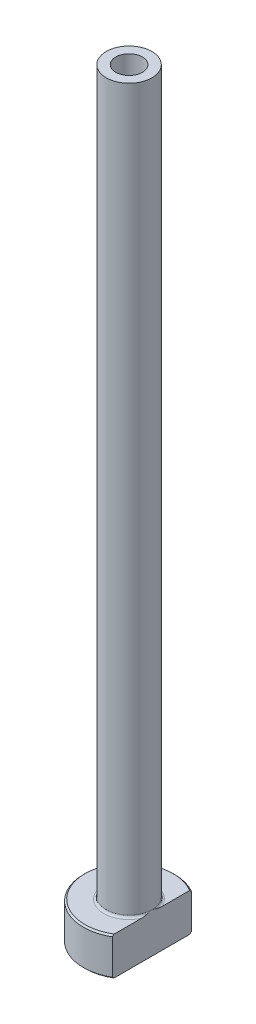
ISO-10303-21;
HEADER;
FILE_DESCRIPTION(('STEP AP214'),'2;1');
FILE_NAME('part.step','',(''),(''),'','','');
FILE_SCHEMA(('AUTOMOTIVE_DESIGN { 1 0 10303 214 1 1 1 1 }'));
ENDSEC;
DATA;
#1=APPLICATION_CONTEXT('core data for automotive mechanical design processes');
#2=APPLICATION_PROTOCOL_DEFINITION('international standard','automotive_design',2000,#1);
#3=PRODUCT_CONTEXT('',#1,'mechanical');
#4=PRODUCT('Part','Part','',(#3));
#5=PRODUCT_RELATED_PRODUCT_CATEGORY('part','',(#4));
#6=PRODUCT_DEFINITION_FORMATION('','',#4);
#7=PRODUCT_DEFINITION_CONTEXT('part definition',#1,'design');
#8=PRODUCT_DEFINITION('design','',#6,#7);
#9=PRODUCT_DEFINITION_SHAPE('','',#8);
#10=(LENGTH_UNIT() NAMED_UNIT(*) SI_UNIT(.MILLI.,.METRE.));
#11=(NAMED_UNIT(*) PLANE_ANGLE_UNIT() SI_UNIT($,.RADIAN.));
#12=(NAMED_UNIT(*) SI_UNIT($,.STERADIAN.) SOLID_ANGLE_UNIT());
#13=UNCERTAINTY_MEASURE_WITH_UNIT(LENGTH_MEASURE(1.E-05),#10,'distance_accuracy_value','');
#14=(GEOMETRIC_REPRESENTATION_CONTEXT(3) GLOBAL_UNCERTAINTY_ASSIGNED_CONTEXT((#13)) GLOBAL_UNIT_ASSIGNED_CONTEXT((#10,
#11,#12)) REPRESENTATION_CONTEXT('',''));
#15=CARTESIAN_POINT('',(0.,0.,0.));
#16=DIRECTION('',(0.,0.,1.));
#17=DIRECTION('',(1.,0.,0.));
#18=AXIS2_PLACEMENT_3D('',#15,#16,#17);
#19=CARTESIAN_POINT('',(0.,92.1876809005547,0.));
#20=DIRECTION('',(0.,1.,0.));
#21=DIRECTION('',(0.,0.,1.));
#22=AXIS2_PLACEMENT_3D('',#19,#20,#21);
#23=CYLINDRICAL_SURFACE('',#22,1.74999999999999);
#24=CARTESIAN_POINT('',(0.,100.,0.));
#25=DIRECTION('',(0.,1.,0.));
#26=DIRECTION('',(0.,0.,1.));
#27=AXIS2_PLACEMENT_3D('',#24,#25,#26);
#28=CIRCLE('',#27,1.74999999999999);
#29=CARTESIAN_POINT('',(0.,100.,1.74999999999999));
#30=VERTEX_POINT('',#29);
#31=EDGE_CURVE('E167',#30,#30,#28,.T.);
#32=ORIENTED_EDGE('',*,*,#31,.T.);
#33=EDGE_LOOP('',(#32));
#34=FACE_BOUND('',#33,.T.);
#35=CARTESIAN_POINT('',(0.,55.,0.));
#36=DIRECTION('',(0.,1.,0.));
#37=DIRECTION('',(0.,0.,1.));
#38=AXIS2_PLACEMENT_3D('',#35,#36,#37);
#39=CIRCLE('',#38,1.74999999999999);
#40=CARTESIAN_POINT('',(0.,55.,1.74999999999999));
#41=VERTEX_POINT('',#40);
#42=EDGE_CURVE('E170',#41,#41,#39,.T.);
#43=ORIENTED_EDGE('',*,*,#42,.F.);
#44=EDGE_LOOP('',(#43));
#45=FACE_BOUND('',#44,.T.);
#46=ADVANCED_FACE('F32',(#34,#45),#23,.F.);
#47=CARTESIAN_POINT('',(-1.74999999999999,100.,0.));
#48=DIRECTION('',(0.,1.,0.));
#49=DIRECTION('',(0.,0.,1.));
#50=AXIS2_PLACEMENT_3D('',#47,#48,#49);
#51=PLANE('',#50);
#52=CARTESIAN_POINT('',(0.,100.,0.));
#53=DIRECTION('',(0.,1.,0.));
#54=DIRECTION('',(0.,0.,1.));
#55=AXIS2_PLACEMENT_3D('',#52,#53,#54);
#56=CIRCLE('',#55,3.);
#57=CARTESIAN_POINT('',(0.,100.,3.));
#58=VERTEX_POINT('',#57);
#59=EDGE_CURVE('E174',#58,#58,#56,.T.);
#60=ORIENTED_EDGE('',*,*,#59,.T.);
#61=EDGE_LOOP('',(#60));
#62=FACE_BOUND('',#61,.T.);
#63=ORIENTED_EDGE('',*,*,#31,.F.);
#64=EDGE_LOOP('',(#63));
#65=FACE_BOUND('',#64,.T.);
#66=ADVANCED_FACE('F157',(#62,#65),#51,.T.);
#67=CARTESIAN_POINT('',(0.,92.1876809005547,0.));
#68=DIRECTION('',(0.,1.,0.));
#69=DIRECTION('',(0.,0.,1.));
#70=AXIS2_PLACEMENT_3D('',#67,#68,#69);
#71=CYLINDRICAL_SURFACE('',#70,2.99999999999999);
#72=CARTESIAN_POINT('',(0.,5.3,0.));
#73=DIRECTION('',(0.,1.,0.));
#74=DIRECTION('',(0.,0.,1.));
#75=AXIS2_PLACEMENT_3D('',#72,#73,#74);
#76=CIRCLE('',#75,2.99999999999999);
#77=CARTESIAN_POINT('',(2.99999999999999,5.3,0.));
#78=VERTEX_POINT('',#77);
#79=EDGE_CURVE('E180',#78,#78,#76,.T.);
#80=ORIENTED_EDGE('',*,*,#79,.T.);
#81=EDGE_LOOP('',(#80));
#82=FACE_BOUND('',#81,.T.);
#83=ORIENTED_EDGE('',*,*,#59,.F.);
#84=EDGE_LOOP('',(#83));
#85=FACE_BOUND('',#84,.T.);
#86=ADVANCED_FACE('F162',(#82,#85),#71,.T.);
#87=CARTESIAN_POINT('',(-2.99999999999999,5.,0.));
#88=DIRECTION('',(0.,1.,0.));
#89=DIRECTION('',(0.,0.,1.));
#90=AXIS2_PLACEMENT_3D('',#87,#88,#89);
#91=PLANE('',#90);
#92=DIRECTION('',(0.,0.,1.));
#93=VECTOR('',#92,1.);
#94=CARTESIAN_POINT('',(2.99999999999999,5.,0.));
#95=LINE('',#94,#93);
#96=CARTESIAN_POINT('',(3.,5.,-4.96386945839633));
#97=VERTEX_POINT('',#96);
#98=CARTESIAN_POINT('',(2.99999999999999,5.,-1.37477270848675));
#99=VERTEX_POINT('',#98);
#100=EDGE_CURVE('E54',#97,#99,#95,.T.);
#101=ORIENTED_EDGE('',*,*,#100,.F.);
#102=CARTESIAN_POINT('',(0.,5.,0.));
#103=DIRECTION('',(0.,1.,0.));
#104=DIRECTION('',(0.,0.,1.));
#105=AXIS2_PLACEMENT_3D('',#102,#103,#104);
#106=CIRCLE('',#105,5.79999999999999);
#107=CARTESIAN_POINT('',(2.99999999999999,5.,4.96386945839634));
#108=VERTEX_POINT('',#107);
#109=EDGE_CURVE('E186',#97,#108,#106,.T.);
#110=ORIENTED_EDGE('',*,*,#109,.T.);
#111=CARTESIAN_POINT('',(2.99999999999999,5.,1.37477270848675));
#112=VERTEX_POINT('',#111);
#113=EDGE_CURVE('E134',#112,#108,#95,.T.);
#114=ORIENTED_EDGE('',*,*,#113,.F.);
#115=CARTESIAN_POINT('',(0.,5.,0.));
#116=DIRECTION('',(0.,1.,0.));
#117=DIRECTION('',(0.,0.,1.));
#118=AXIS2_PLACEMENT_3D('',#115,#116,#117);
#119=CIRCLE('',#118,3.29999999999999);
#120=EDGE_CURVE('E183',#112,#99,#119,.F.);
#121=ORIENTED_EDGE('',*,*,#120,.T.);
#122=EDGE_LOOP('',(#101,#110,#114,#121));
#123=FACE_BOUND('',#122,.T.);
#124=ADVANCED_FACE('F197',(#123),#91,.T.);
#125=CARTESIAN_POINT('',(0.,92.1876809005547,0.));
#126=DIRECTION('',(0.,1.,0.));
#127=DIRECTION('',(0.,0.,1.));
#128=AXIS2_PLACEMENT_3D('',#125,#126,#127);
#129=CYLINDRICAL_SURFACE('',#128,5.99999999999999);
#130=DIRECTION('',(0.,-1.,0.));
#131=VECTOR('',#130,1.);
#132=CARTESIAN_POINT('',(2.99999999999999,100.,5.19615242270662));
#133=LINE('',#132,#131);
#134=CARTESIAN_POINT('',(2.99999999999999,4.79999999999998,5.19615242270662));
#135=VERTEX_POINT('',#134);
#136=CARTESIAN_POINT('',(2.99999999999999,0.200000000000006,5.19615242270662));
#137=VERTEX_POINT('',#136);
#138=EDGE_CURVE('E82',#135,#137,#133,.T.);
#139=ORIENTED_EDGE('',*,*,#138,.F.);
#140=CARTESIAN_POINT('',(0.,4.79999999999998,0.));
#141=DIRECTION('',(0.,1.,0.));
#142=DIRECTION('',(0.,0.,1.));
#143=AXIS2_PLACEMENT_3D('',#140,#141,#142);
#144=CIRCLE('',#143,5.99999999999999);
#145=CARTESIAN_POINT('',(3.,4.79999999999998,-5.19615242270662));
#146=VERTEX_POINT('',#145);
#147=EDGE_CURVE('E95',#135,#146,#144,.F.);
#148=ORIENTED_EDGE('',*,*,#147,.T.);
#149=DIRECTION('',(0.,-1.,0.));
#150=VECTOR('',#149,1.);
#151=CARTESIAN_POINT('',(3.,100.,-5.19615242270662));
#152=LINE('',#151,#150);
#153=CARTESIAN_POINT('',(3.,0.200000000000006,-5.19615242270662));
#154=VERTEX_POINT('',#153);
#155=EDGE_CURVE('E192',#146,#154,#152,.T.);
#156=ORIENTED_EDGE('',*,*,#155,.T.);
#157=CARTESIAN_POINT('',(0.,0.200000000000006,0.));
#158=DIRECTION('',(0.,-1.,0.));
#159=DIRECTION('',(0.,0.,-1.));
#160=AXIS2_PLACEMENT_3D('',#157,#158,#159);
#161=CIRCLE('',#160,5.99999999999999);
#162=EDGE_CURVE('E98',#154,#137,#161,.F.);
#163=ORIENTED_EDGE('',*,*,#162,.T.);
#164=EDGE_LOOP('',(#139,#148,#156,#163));
#165=FACE_BOUND('',#164,.T.);
#166=ADVANCED_FACE('F190',(#165),#129,.T.);
#167=CARTESIAN_POINT('',(-5.99999999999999,0.,0.));
#168=DIRECTION('',(0.,-1.,0.));
#169=DIRECTION('',(0.,0.,-1.));
#170=AXIS2_PLACEMENT_3D('',#167,#168,#169);
#171=PLANE('',#170);
#172=CARTESIAN_POINT('',(0.,0.,0.));
#173=DIRECTION('',(0.,-1.,0.));
#174=DIRECTION('',(0.,0.,-1.));
#175=AXIS2_PLACEMENT_3D('',#172,#173,#174);
#176=CIRCLE('',#175,2.49999999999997);
#177=CARTESIAN_POINT('',(0.,0.,-2.49999999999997));
#178=VERTEX_POINT('',#177);
#179=EDGE_CURVE('E40',#178,#178,#176,.F.);
#180=ORIENTED_EDGE('',*,*,#179,.T.);
#181=EDGE_LOOP('',(#180));
#182=FACE_BOUND('',#181,.T.);
#183=DIRECTION('',(0.,0.,-1.));
#184=VECTOR('',#183,1.);
#185=CARTESIAN_POINT('',(2.99999999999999,0.,5.19615242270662));
#186=LINE('',#185,#184);
#187=CARTESIAN_POINT('',(2.99999999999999,0.,4.96386945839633));
#188=VERTEX_POINT('',#187);
#189=CARTESIAN_POINT('',(2.99999999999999,0.,-4.96386945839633));
#190=VERTEX_POINT('',#189);
#191=EDGE_CURVE('E47',#188,#190,#186,.T.);
#192=ORIENTED_EDGE('',*,*,#191,.F.);
#193=CARTESIAN_POINT('',(0.,0.,0.));
#194=DIRECTION('',(0.,-1.,0.));
#195=DIRECTION('',(0.,0.,-1.));
#196=AXIS2_PLACEMENT_3D('',#193,#194,#195);
#197=CIRCLE('',#196,5.79999999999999);
#198=EDGE_CURVE('E92',#188,#190,#197,.T.);
#199=ORIENTED_EDGE('',*,*,#198,.T.);
#200=EDGE_LOOP('',(#192,#199));
#201=FACE_BOUND('',#200,.T.);
#202=ADVANCED_FACE('F91',(#182,#201),#171,.T.);
#203=CARTESIAN_POINT('',(0.,92.1876809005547,0.));
#204=DIRECTION('',(0.,1.,0.));
#205=DIRECTION('',(0.,0.,1.));
#206=AXIS2_PLACEMENT_3D('',#203,#204,#205);
#207=CYLINDRICAL_SURFACE('',#206,1.99999999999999);
#208=CARTESIAN_POINT('',(0.,0.499999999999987,0.));
#209=DIRECTION('',(0.,-1.,0.));
#210=DIRECTION('',(0.,0.,-1.));
#211=AXIS2_PLACEMENT_3D('',#208,#209,#210);
#212=CIRCLE('',#211,1.99999999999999);
#213=CARTESIAN_POINT('',(0.,0.499999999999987,-1.99999999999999));
#214=VERTEX_POINT('',#213);
#215=EDGE_CURVE('E11',#214,#214,#212,.T.);
#216=ORIENTED_EDGE('',*,*,#215,.T.);
#217=EDGE_LOOP('',(#216));
#218=FACE_BOUND('',#217,.T.);
#219=CARTESIAN_POINT('',(0.,43.,0.));
#220=DIRECTION('',(0.,1.,0.));
#221=DIRECTION('',(0.,0.,1.));
#222=AXIS2_PLACEMENT_3D('',#219,#220,#221);
#223=CIRCLE('',#222,2.);
#224=CARTESIAN_POINT('',(0.,43.,2.));
#225=VERTEX_POINT('',#224);
#226=EDGE_CURVE('E172',#225,#225,#223,.T.);
#227=ORIENTED_EDGE('',*,*,#226,.T.);
#228=EDGE_LOOP('',(#227));
#229=FACE_BOUND('',#228,.T.);
#230=ADVANCED_FACE('F215',(#218,#229),#207,.F.);
#231=CARTESIAN_POINT('',(0.,43.,0.));
#232=DIRECTION('',(0.,-1.,0.));
#233=DIRECTION('',(0.,0.,-1.));
#234=AXIS2_PLACEMENT_3D('',#231,#232,#233);
#235=CONICAL_SURFACE('',#234,2.,0.0208303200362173);
#236=ORIENTED_EDGE('',*,*,#42,.T.);
#237=EDGE_LOOP('',(#236));
#238=FACE_BOUND('',#237,.T.);
#239=ORIENTED_EDGE('',*,*,#226,.F.);
#240=EDGE_LOOP('',(#239));
#241=FACE_BOUND('',#240,.T.);
#242=ADVANCED_FACE('F111',(#238,#241),#235,.F.);
#243=CARTESIAN_POINT('',(0.,5.3,0.));
#244=DIRECTION('',(0.,1.,0.));
#245=DIRECTION('',(0.,0.,1.));
#246=AXIS2_PLACEMENT_3D('',#243,#244,#245);
#247=TOROIDAL_SURFACE('',#246,3.29999999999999,0.3);
#248=ORIENTED_EDGE('',*,*,#120,.F.);
#249=CARTESIAN_POINT('',(2.99999999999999,5.3,0.));
#250=CARTESIAN_POINT('',(2.99999999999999,5.3000006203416,-1.12611385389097E-10));
#251=CARTESIAN_POINT('',(2.99999999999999,5.30000124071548,1.79706759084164E-07));
#252=CARTESIAN_POINT('',(2.99999999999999,5.30000241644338,7.12597434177E-07));
#253=CARTESIAN_POINT('',(2.99999999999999,5.30000296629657,1.07470894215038E-06));
#254=CARTESIAN_POINT('',(2.99999999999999,5.30000408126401,1.93940802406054E-06));
#255=CARTESIAN_POINT('',(2.99999999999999,5.30000463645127,2.45488588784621E-06));
#256=CARTESIAN_POINT('',(2.99999999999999,5.30000565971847,3.54465517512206E-06));
#257=CARTESIAN_POINT('',(2.99999999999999,5.30000612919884,4.1177066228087E-06));
#258=CARTESIAN_POINT('',(2.99999999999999,5.30000778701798,6.25396429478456E-06));
#259=CARTESIAN_POINT('',(2.99999999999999,5.30000888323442,7.89070824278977E-06));
#260=CARTESIAN_POINT('',(2.99999999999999,5.30001076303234,1.11998049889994E-05));
#261=CARTESIAN_POINT('',(2.99999999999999,5.30001156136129,1.28642109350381E-05));
#262=CARTESIAN_POINT('',(2.99999999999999,5.30001474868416,1.96537166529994E-05));
#263=CARTESIAN_POINT('',(2.99999999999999,5.30001702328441,2.48380231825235E-05));
#264=CARTESIAN_POINT('',(2.99999999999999,5.30002052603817,3.48178474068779E-05));
#265=CARTESIAN_POINT('',(2.99999999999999,5.30002184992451,3.95800617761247E-05));
#266=CARTESIAN_POINT('',(2.99999999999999,5.30003122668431,7.41814363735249E-05));
#267=CARTESIAN_POINT('',(2.99999999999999,5.30003808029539,0.000104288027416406));
#268=CARTESIAN_POINT('',(2.99999999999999,5.30006804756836,0.000222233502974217));
#269=CARTESIAN_POINT('',(2.99999999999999,5.30009687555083,0.000308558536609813));
#270=CARTESIAN_POINT('',(2.99999999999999,5.30020809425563,0.000648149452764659));
#271=CARTESIAN_POINT('',(2.99999999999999,5.30028657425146,0.000902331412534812));
#272=CARTESIAN_POINT('',(2.99999999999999,5.30059876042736,0.00190491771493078));
#273=CARTESIAN_POINT('',(2.99999999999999,5.30083723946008,0.00265218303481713));
#274=CARTESIAN_POINT('',(2.99999999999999,5.30182192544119,0.0057469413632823));
#275=CARTESIAN_POINT('',(2.99999999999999,5.30256224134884,0.00809584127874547));
#276=CARTESIAN_POINT('',(2.99999999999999,5.31160267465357,0.0367678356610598));
#277=CARTESIAN_POINT('',(2.99999999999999,5.31993817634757,0.0630827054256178));
#278=CARTESIAN_POINT('',(2.99999999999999,5.33621504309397,0.114704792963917));
#279=CARTESIAN_POINT('',(2.99999999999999,5.3441590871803,0.140011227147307));
#280=CARTESIAN_POINT('',(2.99999999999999,5.36094382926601,0.19377488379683));
#281=CARTESIAN_POINT('',(2.99999999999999,5.36977415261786,0.222235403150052));
#282=CARTESIAN_POINT('',(2.99999999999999,5.38736474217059,0.279512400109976));
#283=CARTESIAN_POINT('',(2.99999999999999,5.3961232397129,0.308329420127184));
#284=CARTESIAN_POINT('',(2.99999999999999,5.41726575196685,0.378880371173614));
#285=CARTESIAN_POINT('',(2.99999999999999,5.4295272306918,0.420651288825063));
#286=CARTESIAN_POINT('',(2.99999999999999,5.45309597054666,0.50335758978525));
#287=CARTESIAN_POINT('',(2.99999999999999,5.46441924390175,0.544288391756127));
#288=CARTESIAN_POINT('',(2.99999999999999,5.48778169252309,0.632156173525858));
#289=CARTESIAN_POINT('',(2.99999999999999,5.49969678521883,0.67912648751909));
#290=CARTESIAN_POINT('',(2.99999999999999,5.52221484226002,0.773740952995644));
#291=CARTESIAN_POINT('',(2.99999999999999,5.532807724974,0.821387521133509));
#292=CARTESIAN_POINT('',(2.99999999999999,5.55291503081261,0.920589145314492));
#293=CARTESIAN_POINT('',(2.99999999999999,5.5622918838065,0.972172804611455));
#294=CARTESIAN_POINT('',(2.99999999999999,5.57838694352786,1.07574836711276));
#295=CARTESIAN_POINT('',(2.99999999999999,5.58510535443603,1.12774023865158));
#296=CARTESIAN_POINT('',(2.99999999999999,5.59681427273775,1.24924411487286));
#297=CARTESIAN_POINT('',(2.99999999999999,5.60051317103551,1.31890364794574));
#298=CARTESIAN_POINT('',(2.99999999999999,5.59966579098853,1.42270835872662));
#299=CARTESIAN_POINT('',(2.99999999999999,5.59835823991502,1.45688093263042));
#300=CARTESIAN_POINT('',(2.99999999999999,5.59322745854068,1.52502533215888));
#301=CARTESIAN_POINT('',(2.99999999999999,5.58940645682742,1.5589973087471));
#302=CARTESIAN_POINT('',(2.99999999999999,5.57976146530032,1.61947815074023));
#303=CARTESIAN_POINT('',(2.99999999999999,5.5745150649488,1.64607760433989));
#304=CARTESIAN_POINT('',(2.99999999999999,5.56161153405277,1.69883648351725));
#305=CARTESIAN_POINT('',(2.99999999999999,5.55394338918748,1.7249933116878));
#306=CARTESIAN_POINT('',(2.99999999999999,5.53555176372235,1.77650913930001));
#307=CARTESIAN_POINT('',(2.99999999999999,5.52480031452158,1.80185836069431));
#308=CARTESIAN_POINT('',(2.99999999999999,5.49948027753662,1.85054545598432));
#309=CARTESIAN_POINT('',(2.99999999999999,5.48493141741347,1.87389291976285));
#310=CARTESIAN_POINT('',(2.99999999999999,5.45992470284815,1.90552135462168));
#311=CARTESIAN_POINT('',(2.99999999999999,5.45133318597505,1.91527363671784));
#312=CARTESIAN_POINT('',(2.99999999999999,5.43294163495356,1.93360072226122));
#313=CARTESIAN_POINT('',(2.99999999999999,5.42314083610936,1.94217477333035));
#314=CARTESIAN_POINT('',(2.99999999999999,5.40215892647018,1.95778354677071));
#315=CARTESIAN_POINT('',(2.99999999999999,5.39096156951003,1.96479687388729));
#316=CARTESIAN_POINT('',(2.99999999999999,5.36742144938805,1.97652218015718));
#317=CARTESIAN_POINT('',(2.99999999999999,5.35508207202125,1.98124071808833));
#318=CARTESIAN_POINT('',(2.99999999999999,5.33320117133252,1.98690185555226));
#319=CARTESIAN_POINT('',(2.99999999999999,5.32383559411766,1.98852953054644));
#320=CARTESIAN_POINT('',(2.99999999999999,5.30496375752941,1.99016898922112));
#321=CARTESIAN_POINT('',(2.99999999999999,5.29545756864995,1.99018155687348));
#322=CARTESIAN_POINT('',(2.99999999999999,5.27659318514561,1.98858978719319));
#323=CARTESIAN_POINT('',(2.99999999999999,5.26723486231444,1.9869869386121));
#324=CARTESIAN_POINT('',(2.99999999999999,5.24889957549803,1.98229727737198));
#325=CARTESIAN_POINT('',(2.99999999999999,5.23992286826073,1.97920948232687));
#326=CARTESIAN_POINT('',(2.99999999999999,5.21981293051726,1.97059641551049));
#327=CARTESIAN_POINT('',(2.99999999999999,5.20887713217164,1.96461176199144));
#328=CARTESIAN_POINT('',(2.99999999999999,5.18811536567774,1.95095727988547));
#329=CARTESIAN_POINT('',(2.99999999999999,5.17829177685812,1.94328393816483));
#330=CARTESIAN_POINT('',(2.99999999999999,5.15512177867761,1.9225422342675));
#331=CARTESIAN_POINT('',(2.99999999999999,5.14247568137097,1.90869680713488));
#332=CARTESIAN_POINT('',(2.99999999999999,5.11944595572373,1.87927587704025));
#333=CARTESIAN_POINT('',(2.99999999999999,5.10906527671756,1.86369815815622));
#334=CARTESIAN_POINT('',(2.99999999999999,5.08309609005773,1.81927355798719));
#335=CARTESIAN_POINT('',(2.99999999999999,5.06948546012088,1.78928084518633));
#336=CARTESIAN_POINT('',(2.99999999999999,5.04658664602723,1.72751962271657));
#337=CARTESIAN_POINT('',(2.99999999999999,5.03733582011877,1.69573828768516));
#338=CARTESIAN_POINT('',(2.99999999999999,5.02214318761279,1.63079918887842));
#339=CARTESIAN_POINT('',(2.99999999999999,5.0162653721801,1.59762686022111));
#340=CARTESIAN_POINT('',(2.99999999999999,5.00734002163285,1.53086029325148));
#341=CARTESIAN_POINT('',(2.99999999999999,5.00429797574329,1.49726536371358));
#342=CARTESIAN_POINT('',(2.99999999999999,5.00059037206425,1.4310087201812));
#343=CARTESIAN_POINT('',(2.99999999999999,4.99985343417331,1.39835069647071));
#344=CARTESIAN_POINT('',(2.99999999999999,5.00019322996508,1.33318312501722));
#345=CARTESIAN_POINT('',(2.99999999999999,5.00126261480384,1.30067351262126));
#346=CARTESIAN_POINT('',(2.99999999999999,5.00569854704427,1.2219046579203));
#347=CARTESIAN_POINT('',(2.99999999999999,5.00984986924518,1.17569031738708));
#348=CARTESIAN_POINT('',(2.99999999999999,5.0206087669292,1.08357061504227));
#349=CARTESIAN_POINT('',(2.99999999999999,5.02721586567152,1.03766519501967));
#350=CARTESIAN_POINT('',(2.99999999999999,5.04258096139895,0.945130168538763));
#351=CARTESIAN_POINT('',(2.99999999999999,5.05138514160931,0.898508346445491));
#352=CARTESIAN_POINT('',(2.99999999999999,5.07066869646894,0.805496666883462));
#353=CARTESIAN_POINT('',(2.99999999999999,5.08115218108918,0.759107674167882));
#354=CARTESIAN_POINT('',(2.99999999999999,5.10738921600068,0.650207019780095));
#355=CARTESIAN_POINT('',(2.99999999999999,5.12369110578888,0.587828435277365));
#356=CARTESIAN_POINT('',(2.99999999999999,5.15777680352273,0.464212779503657));
#357=CARTESIAN_POINT('',(2.99999999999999,5.17554263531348,0.402970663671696));
#358=CARTESIAN_POINT('',(2.99999999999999,5.21006724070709,0.287596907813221));
#359=CARTESIAN_POINT('',(2.99999999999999,5.22671796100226,0.233432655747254));
#360=CARTESIAN_POINT('',(2.99999999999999,5.25241226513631,0.150940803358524));
#361=CARTESIAN_POINT('',(2.99999999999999,5.26131063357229,0.122567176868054));
#362=CARTESIAN_POINT('',(2.99999999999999,5.27905176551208,0.0662804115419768));
#363=CARTESIAN_POINT('',(2.99999999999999,5.28789327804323,0.0383669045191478));
#364=CARTESIAN_POINT('',(2.99999999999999,5.29743877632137,0.00809257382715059));
#365=CARTESIAN_POINT('',(2.99999999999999,5.298180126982,0.00574041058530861));
#366=CARTESIAN_POINT('',(2.99999999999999,5.2991650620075,0.00264489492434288));
#367=CARTESIAN_POINT('',(2.99999999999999,5.29940274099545,0.00190013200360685));
#368=CARTESIAN_POINT('',(2.99999999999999,5.29971394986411,0.000900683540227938));
#369=CARTESIAN_POINT('',(2.99999999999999,5.29979223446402,0.000647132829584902));
#370=CARTESIAN_POINT('',(2.99999999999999,5.29990321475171,0.000308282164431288));
#371=CARTESIAN_POINT('',(2.99999999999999,5.29993200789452,0.000222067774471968));
#372=CARTESIAN_POINT('',(2.99999999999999,5.29996194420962,0.000104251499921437));
#373=CARTESIAN_POINT('',(2.99999999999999,5.29996879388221,7.41614201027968E-05));
#374=CARTESIAN_POINT('',(2.99999999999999,5.29997816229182,3.95766681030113E-05));
#375=CARTESIAN_POINT('',(2.99999999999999,5.29997948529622,3.48154638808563E-05));
#376=CARTESIAN_POINT('',(2.99999999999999,5.2999829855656,2.48376256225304E-05));
#377=CARTESIAN_POINT('',(2.99999999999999,5.29998525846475,1.96542435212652E-05));
#378=CARTESIAN_POINT('',(2.99999999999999,5.29998844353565,1.2865664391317E-05));
#379=CARTESIAN_POINT('',(2.99999999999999,5.29998924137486,1.12013338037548E-05));
#380=CARTESIAN_POINT('',(2.99999999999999,5.29999112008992,7.89229927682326E-06));
#381=CARTESIAN_POINT('',(2.99999999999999,5.29999221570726,6.25553453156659E-06));
#382=CARTESIAN_POINT('',(2.99999999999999,5.29999387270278,4.11914316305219E-06));
#383=CARTESIAN_POINT('',(2.99999999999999,5.29999434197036,3.54603043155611E-06));
#384=CARTESIAN_POINT('',(2.99999999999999,5.29999536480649,2.4561002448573E-06));
#385=CARTESIAN_POINT('',(2.99999999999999,5.29999591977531,1.9405219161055E-06));
#386=CARTESIAN_POINT('',(2.99999999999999,5.29999703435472,1.07558297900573E-06));
#387=CARTESIAN_POINT('',(2.99999999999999,5.29999758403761,7.13339240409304E-07));
#388=CARTESIAN_POINT('',(2.99999999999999,5.29999875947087,1.80121854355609E-07));
#389=CARTESIAN_POINT('',(2.99999999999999,5.2999993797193,1.12600830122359E-10));
#390=CARTESIAN_POINT('',(2.99999999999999,5.3,0.));
#391=B_SPLINE_CURVE_WITH_KNOTS('',3,(#249,#250,#251,#252,#253,#254,#255,#256,#257,#258,#259,
#260,#261,#262,#263,#264,#265,#266,#267,#268,#269,#270,#271,#272,#273,#274,#275,#276,#277,#278,
#279,#280,#281,#282,#283,#284,#285,#286,#287,#288,#289,#290,#291,#292,#293,#294,#295,#296,#297,
#298,#299,#300,#301,#302,#303,#304,#305,#306,#307,#308,#309,#310,#311,#312,#313,#314,#315,#316,
#317,#318,#319,#320,#321,#322,#323,#324,#325,#326,#327,#328,#329,#330,#331,#332,#333,#334,#335,
#336,#337,#338,#339,#340,#341,#342,#343,#344,#345,#346,#347,#348,#349,#350,#351,#352,#353,#354,
#355,#356,#357,#358,#359,#360,#361,#362,#363,#364,#365,#366,#367,#368,#369,#370,#371,#372,#373,
#374,#375,#376,#377,#378,#379,#380,#381,#382,#383,#384,#385,#386,#387,#388,#389,#390),
.UNSPECIFIED.,.T.,.F.,(4,2,2,2,2,2,2,2,2,2,2,2,2,2,2,2,2,2,2,2,2,2,2,2,2,2,2,2,2,2,2,2,2,2,2,2,
2,2,2,2,2,2,2,2,2,2,2,2,2,2,2,2,2,2,2,2,2,2,2,2,2,2,2,2,2,2,2,2,2,2,4),(0.,1.86513959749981E-06,
3.83353422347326E-06,6.09513468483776E-06,8.31560835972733E-06,1.42000733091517E-05,
1.97335541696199E-05,3.66769904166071E-05,5.1485836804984E-05,0.000144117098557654,
0.000416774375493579,0.00121521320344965,0.00356794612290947,0.0109568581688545,
0.0937636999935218,0.173336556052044,0.262732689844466,0.353088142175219,0.483684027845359,
0.611082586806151,0.756439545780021,0.90284470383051,1.06007042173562,1.21728406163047,
1.42611662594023,1.52864191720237,1.63107642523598,1.7123285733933,1.79395571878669,
1.87634808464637,1.95832065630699,1.99722769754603,2.03615946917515,2.07559591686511,
2.1149189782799,2.1433091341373,2.17168550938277,2.20003575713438,2.22840478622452,
2.26559554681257,2.30286442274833,2.35880214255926,2.41481225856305,2.51307007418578,
2.6121551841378,2.71306273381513,2.81416520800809,2.91210427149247,3.00964583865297,
3.14875779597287,3.28784276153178,3.43014232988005,3.57279564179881,3.76617940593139,
3.95746724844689,4.1274607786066,4.21667041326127,4.30450746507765,4.3119066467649,
4.31425150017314,4.31504795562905,4.3153202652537,4.31541284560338,4.31542765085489,
4.31544458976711,4.31545012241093,4.31545600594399,4.3154582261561,4.31546048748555,
4.3154624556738,4.31546432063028),.UNSPECIFIED.);
#392=EDGE_CURVE('E126',#112,#78,#391,.T.);
#393=ORIENTED_EDGE('',*,*,#392,.T.);
#394=ORIENTED_EDGE('',*,*,#79,.F.);
#395=CARTESIAN_POINT('',(2.99999999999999,5.3,0.));
#396=CARTESIAN_POINT('',(2.99999999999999,5.2999993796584,1.12611872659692E-10));
#397=CARTESIAN_POINT('',(2.99999999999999,5.29999875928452,-1.7970675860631E-07));
#398=CARTESIAN_POINT('',(2.99999999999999,5.29999758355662,-7.12597433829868E-07));
#399=CARTESIAN_POINT('',(2.99999999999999,5.29999703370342,-1.07470894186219E-06));
#400=CARTESIAN_POINT('',(2.99999999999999,5.29999591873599,-1.93940802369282E-06));
#401=CARTESIAN_POINT('',(2.99999999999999,5.29999536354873,-2.45488588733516E-06));
#402=CARTESIAN_POINT('',(2.99999999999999,5.29999434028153,-3.5446551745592E-06));
#403=CARTESIAN_POINT('',(2.99999999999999,5.29999387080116,-4.11770662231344E-06));
#404=CARTESIAN_POINT('',(2.99999999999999,5.29999221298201,-6.25396429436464E-06));
#405=CARTESIAN_POINT('',(2.99999999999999,5.29999111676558,-7.89070824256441E-06));
#406=CARTESIAN_POINT('',(2.99999999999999,5.29998923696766,-1.11998049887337E-05));
#407=CARTESIAN_POINT('',(2.99999999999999,5.29998843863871,-1.28642109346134E-05));
#408=CARTESIAN_POINT('',(2.99999999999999,5.29998525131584,-1.9653716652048E-05));
#409=CARTESIAN_POINT('',(2.99999999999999,5.29998297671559,-2.48380231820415E-05));
#410=CARTESIAN_POINT('',(2.99999999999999,5.29997947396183,-3.48178474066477E-05));
#411=CARTESIAN_POINT('',(2.99999999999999,5.29997815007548,-3.95800617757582E-05));
#412=CARTESIAN_POINT('',(2.99999999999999,5.29996877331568,-7.41814363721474E-05));
#413=CARTESIAN_POINT('',(2.99999999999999,5.29996191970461,-0.000104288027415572));
#414=CARTESIAN_POINT('',(2.99999999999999,5.29993195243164,-0.000222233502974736));
#415=CARTESIAN_POINT('',(2.99999999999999,5.29990312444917,-0.000308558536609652));
#416=CARTESIAN_POINT('',(2.99999999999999,5.29979190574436,-0.000648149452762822));
#417=CARTESIAN_POINT('',(2.99999999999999,5.29971342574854,-0.000902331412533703));
#418=CARTESIAN_POINT('',(2.99999999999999,5.29940123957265,-0.00190491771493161));
#419=CARTESIAN_POINT('',(2.99999999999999,5.29916276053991,-0.00265218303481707));
#420=CARTESIAN_POINT('',(2.99999999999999,5.2981780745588,-0.00574694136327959));
#421=CARTESIAN_POINT('',(2.99999999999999,5.29743775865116,-0.00809584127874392));
#422=CARTESIAN_POINT('',(2.99999999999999,5.28839732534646,-0.0367678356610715));
#423=CARTESIAN_POINT('',(2.99999999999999,5.28006182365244,-0.0630827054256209));
#424=CARTESIAN_POINT('',(2.99999999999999,5.26378495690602,-0.114704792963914));
#425=CARTESIAN_POINT('',(2.99999999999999,5.2558409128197,-0.140011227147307));
#426=CARTESIAN_POINT('',(2.99999999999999,5.23905617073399,-0.193774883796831));
#427=CARTESIAN_POINT('',(2.99999999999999,5.23022584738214,-0.222235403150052));
#428=CARTESIAN_POINT('',(2.99999999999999,5.2126352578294,-0.279512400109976));
#429=CARTESIAN_POINT('',(2.99999999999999,5.2038767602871,-0.308329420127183));
#430=CARTESIAN_POINT('',(2.99999999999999,5.18273424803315,-0.378880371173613));
#431=CARTESIAN_POINT('',(2.99999999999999,5.1704727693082,-0.420651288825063));
#432=CARTESIAN_POINT('',(2.99999999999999,5.14690402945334,-0.50335758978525));
#433=CARTESIAN_POINT('',(2.99999999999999,5.13558075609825,-0.544288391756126));
#434=CARTESIAN_POINT('',(2.99999999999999,5.11221830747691,-0.632156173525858));
#435=CARTESIAN_POINT('',(2.99999999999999,5.10030321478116,-0.679126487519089));
#436=CARTESIAN_POINT('',(2.99999999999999,5.07778515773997,-0.773740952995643));
#437=CARTESIAN_POINT('',(2.99999999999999,5.067192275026,-0.821387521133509));
#438=CARTESIAN_POINT('',(2.99999999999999,5.04708496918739,-0.920589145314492));
#439=CARTESIAN_POINT('',(2.99999999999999,5.0377081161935,-0.972172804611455));
#440=CARTESIAN_POINT('',(2.99999999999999,5.02161305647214,-1.07574836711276));
#441=CARTESIAN_POINT('',(2.99999999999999,5.01489464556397,-1.12774023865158));
#442=CARTESIAN_POINT('',(2.99999999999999,5.00318572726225,-1.24924411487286));
#443=CARTESIAN_POINT('',(2.99999999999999,4.99948682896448,-1.31890364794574));
#444=CARTESIAN_POINT('',(2.99999999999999,5.00033420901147,-1.42270835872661));
#445=CARTESIAN_POINT('',(2.99999999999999,5.00164176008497,-1.45688093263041));
#446=CARTESIAN_POINT('',(2.99999999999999,5.00677254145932,-1.52502533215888));
#447=CARTESIAN_POINT('',(2.99999999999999,5.01059354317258,-1.5589973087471));
#448=CARTESIAN_POINT('',(2.99999999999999,5.02023853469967,-1.61947815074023));
#449=CARTESIAN_POINT('',(2.99999999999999,5.0254849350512,-1.64607760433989));
#450=CARTESIAN_POINT('',(2.99999999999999,5.03838846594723,-1.69883648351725));
#451=CARTESIAN_POINT('',(2.99999999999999,5.04605661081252,-1.7249933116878));
#452=CARTESIAN_POINT('',(2.99999999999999,5.06444823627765,-1.77650913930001));
#453=CARTESIAN_POINT('',(2.99999999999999,5.07519968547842,-1.80185836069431));
#454=CARTESIAN_POINT('',(2.99999999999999,5.10051972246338,-1.85054545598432));
#455=CARTESIAN_POINT('',(2.99999999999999,5.11506858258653,-1.87389291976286));
#456=CARTESIAN_POINT('',(2.99999999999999,5.14007529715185,-1.90552135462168));
#457=CARTESIAN_POINT('',(2.99999999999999,5.14866681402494,-1.91527363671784));
#458=CARTESIAN_POINT('',(2.99999999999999,5.16705836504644,-1.93360072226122));
#459=CARTESIAN_POINT('',(2.99999999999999,5.17685916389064,-1.94217477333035));
#460=CARTESIAN_POINT('',(2.99999999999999,5.19784107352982,-1.95778354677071));
#461=CARTESIAN_POINT('',(2.99999999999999,5.20903843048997,-1.96479687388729));
#462=CARTESIAN_POINT('',(2.99999999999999,5.23257855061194,-1.97652218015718));
#463=CARTESIAN_POINT('',(2.99999999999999,5.24491792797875,-1.98124071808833));
#464=CARTESIAN_POINT('',(2.99999999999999,5.26679882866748,-1.98690185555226));
#465=CARTESIAN_POINT('',(2.99999999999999,5.27616440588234,-1.98852953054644));
#466=CARTESIAN_POINT('',(2.99999999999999,5.29503624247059,-1.99016898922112));
#467=CARTESIAN_POINT('',(2.99999999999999,5.30454243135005,-1.99018155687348));
#468=CARTESIAN_POINT('',(2.99999999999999,5.32340681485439,-1.98858978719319));
#469=CARTESIAN_POINT('',(2.99999999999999,5.33276513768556,-1.9869869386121));
#470=CARTESIAN_POINT('',(2.99999999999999,5.35110042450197,-1.98229727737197));
#471=CARTESIAN_POINT('',(2.99999999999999,5.36007713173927,-1.97920948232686));
#472=CARTESIAN_POINT('',(2.99999999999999,5.38018706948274,-1.97059641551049));
#473=CARTESIAN_POINT('',(2.99999999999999,5.39112286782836,-1.96461176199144));
#474=CARTESIAN_POINT('',(2.99999999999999,5.41188463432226,-1.95095727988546));
#475=CARTESIAN_POINT('',(2.99999999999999,5.42170822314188,-1.94328393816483));
#476=CARTESIAN_POINT('',(2.99999999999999,5.44487822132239,-1.9225422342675));
#477=CARTESIAN_POINT('',(2.99999999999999,5.45752431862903,-1.90869680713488));
#478=CARTESIAN_POINT('',(2.99999999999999,5.48055404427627,-1.87927587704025));
#479=CARTESIAN_POINT('',(2.99999999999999,5.49093472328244,-1.86369815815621));
#480=CARTESIAN_POINT('',(2.99999999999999,5.51690390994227,-1.81927355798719));
#481=CARTESIAN_POINT('',(2.99999999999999,5.53051453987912,-1.78928084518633));
#482=CARTESIAN_POINT('',(2.99999999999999,5.55341335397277,-1.72751962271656));
#483=CARTESIAN_POINT('',(2.99999999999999,5.56266417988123,-1.69573828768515));
#484=CARTESIAN_POINT('',(2.99999999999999,5.57785681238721,-1.63079918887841));
#485=CARTESIAN_POINT('',(2.99999999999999,5.5837346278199,-1.5976268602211));
#486=CARTESIAN_POINT('',(2.99999999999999,5.59265997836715,-1.53086029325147));
#487=CARTESIAN_POINT('',(2.99999999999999,5.59570202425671,-1.49726536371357));
#488=CARTESIAN_POINT('',(2.99999999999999,5.59940962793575,-1.43100872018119));
#489=CARTESIAN_POINT('',(2.99999999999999,5.60014656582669,-1.3983506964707));
#490=CARTESIAN_POINT('',(2.99999999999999,5.59980677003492,-1.33318312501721));
#491=CARTESIAN_POINT('',(2.99999999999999,5.59873738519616,-1.30067351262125));
#492=CARTESIAN_POINT('',(2.99999999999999,5.59430145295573,-1.22190465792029));
#493=CARTESIAN_POINT('',(2.99999999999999,5.59015013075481,-1.17569031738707));
#494=CARTESIAN_POINT('',(2.99999999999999,5.5793912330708,-1.08357061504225));
#495=CARTESIAN_POINT('',(2.99999999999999,5.57278413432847,-1.03766519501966));
#496=CARTESIAN_POINT('',(2.99999999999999,5.55741903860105,-0.945130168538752));
#497=CARTESIAN_POINT('',(2.99999999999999,5.54861485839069,-0.898508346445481));
#498=CARTESIAN_POINT('',(2.99999999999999,5.52933130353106,-0.805496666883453));
#499=CARTESIAN_POINT('',(2.99999999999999,5.51884781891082,-0.759107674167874));
#500=CARTESIAN_POINT('',(2.99999999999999,5.49261078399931,-0.650207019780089));
#501=CARTESIAN_POINT('',(2.99999999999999,5.47630889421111,-0.587828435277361));
#502=CARTESIAN_POINT('',(2.99999999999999,5.44222319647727,-0.464212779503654));
#503=CARTESIAN_POINT('',(2.99999999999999,5.42445736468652,-0.402970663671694));
#504=CARTESIAN_POINT('',(2.99999999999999,5.38993275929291,-0.287596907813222));
#505=CARTESIAN_POINT('',(2.99999999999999,5.37328203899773,-0.233432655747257));
#506=CARTESIAN_POINT('',(2.99999999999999,5.34758773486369,-0.150940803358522));
#507=CARTESIAN_POINT('',(2.99999999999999,5.33868936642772,-0.122567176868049));
#508=CARTESIAN_POINT('',(2.99999999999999,5.32094823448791,-0.0662804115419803));
#509=CARTESIAN_POINT('',(2.99999999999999,5.31210672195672,-0.0383669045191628));
#510=CARTESIAN_POINT('',(2.99999999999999,5.30256122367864,-0.00809257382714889));
#511=CARTESIAN_POINT('',(2.99999999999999,5.30181987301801,-0.00574041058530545));
#512=CARTESIAN_POINT('',(2.99999999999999,5.30083493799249,-0.00264489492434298));
#513=CARTESIAN_POINT('',(2.99999999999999,5.30059725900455,-0.00190013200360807));
#514=CARTESIAN_POINT('',(2.99999999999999,5.30028605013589,-0.000900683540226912));
#515=CARTESIAN_POINT('',(2.99999999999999,5.30020776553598,-0.000647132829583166));
#516=CARTESIAN_POINT('',(2.99999999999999,5.30009678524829,-0.000308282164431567));
#517=CARTESIAN_POINT('',(2.99999999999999,5.30006799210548,-0.000222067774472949));
#518=CARTESIAN_POINT('',(2.99999999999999,5.30003805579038,-0.000104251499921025));
#519=CARTESIAN_POINT('',(2.99999999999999,5.30003120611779,-7.41614201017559E-05));
#520=CARTESIAN_POINT('',(2.99999999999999,5.30002183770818,-3.95766681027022E-05));
#521=CARTESIAN_POINT('',(2.99999999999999,5.30002051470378,-3.48154638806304E-05));
#522=CARTESIAN_POINT('',(2.99999999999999,5.30001701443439,-2.48376256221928E-05));
#523=CARTESIAN_POINT('',(2.99999999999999,5.30001474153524,-1.96542435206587E-05));
#524=CARTESIAN_POINT('',(2.99999999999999,5.30001155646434,-1.28656643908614E-05));
#525=CARTESIAN_POINT('',(2.99999999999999,5.30001075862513,-1.12013338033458E-05));
#526=CARTESIAN_POINT('',(2.99999999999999,5.30000887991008,-7.89229927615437E-06));
#527=CARTESIAN_POINT('',(2.99999999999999,5.30000778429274,-6.25553453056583E-06));
#528=CARTESIAN_POINT('',(2.99999999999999,5.30000612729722,-4.11914316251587E-06));
#529=CARTESIAN_POINT('',(2.99999999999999,5.30000565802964,-3.54603043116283E-06));
#530=CARTESIAN_POINT('',(2.99999999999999,5.3000046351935,-2.45610024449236E-06));
#531=CARTESIAN_POINT('',(2.99999999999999,5.30000408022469,-1.94052191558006E-06));
#532=CARTESIAN_POINT('',(2.99999999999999,5.30000296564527,-1.07558297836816E-06));
#533=CARTESIAN_POINT('',(2.99999999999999,5.30000241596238,-7.13339239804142E-07));
#534=CARTESIAN_POINT('',(2.99999999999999,5.30000124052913,-1.80121853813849E-07));
#535=CARTESIAN_POINT('',(2.99999999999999,5.3000006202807,-1.12600315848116E-10));
#536=CARTESIAN_POINT('',(2.99999999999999,5.3,0.));
#537=B_SPLINE_CURVE_WITH_KNOTS('',3,(#395,#396,#397,#398,#399,#400,#401,#402,#403,#404,#405,
#406,#407,#408,#409,#410,#411,#412,#413,#414,#415,#416,#417,#418,#419,#420,#421,#422,#423,#424,
#425,#426,#427,#428,#429,#430,#431,#432,#433,#434,#435,#436,#437,#438,#439,#440,#441,#442,#443,
#444,#445,#446,#447,#448,#449,#450,#451,#452,#453,#454,#455,#456,#457,#458,#459,#460,#461,#462,
#463,#464,#465,#466,#467,#468,#469,#470,#471,#472,#473,#474,#475,#476,#477,#478,#479,#480,#481,
#482,#483,#484,#485,#486,#487,#488,#489,#490,#491,#492,#493,#494,#495,#496,#497,#498,#499,#500,
#501,#502,#503,#504,#505,#506,#507,#508,#509,#510,#511,#512,#513,#514,#515,#516,#517,#518,#519,
#520,#521,#522,#523,#524,#525,#526,#527,#528,#529,#530,#531,#532,#533,#534,#535,#536),
.UNSPECIFIED.,.T.,.F.,(4,2,2,2,2,2,2,2,2,2,2,2,2,2,2,2,2,2,2,2,2,2,2,2,2,2,2,2,2,2,2,2,2,2,2,2,
2,2,2,2,2,2,2,2,2,2,2,2,2,2,2,2,2,2,2,2,2,2,2,2,2,2,2,2,2,2,2,2,2,2,4),(0.,1.86513959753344E-06,
3.83353422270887E-06,6.09513468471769E-06,8.31560835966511E-06,1.42000733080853E-05,
1.97335541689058E-05,3.6676990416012E-05,5.14858368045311E-05,0.000144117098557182,
0.000416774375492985,0.00121521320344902,0.00356794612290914,0.010956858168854,
0.0937636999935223,0.173336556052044,0.262732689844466,0.353088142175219,0.483684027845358,
0.611082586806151,0.75643954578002,0.902844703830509,1.06007042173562,1.21728406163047,
1.42611662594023,1.52864191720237,1.63107642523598,1.7123285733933,1.79395571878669,
1.87634808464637,1.958320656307,1.99722769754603,2.03615946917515,2.07559591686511,
2.1149189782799,2.1433091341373,2.17168550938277,2.20003575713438,2.22840478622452,
2.26559554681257,2.30286442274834,2.35880214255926,2.41481225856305,2.51307007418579,
2.6121551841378,2.71306273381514,2.8141652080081,2.91210427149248,3.00964583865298,
3.14875779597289,3.28784276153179,3.43014232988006,3.57279564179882,3.76617940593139,
3.95746724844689,4.1274607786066,4.21667041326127,4.30450746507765,4.3119066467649,
4.31425150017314,4.31504795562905,4.3153202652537,4.31541284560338,4.31542765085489,
4.31544458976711,4.31545012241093,4.31545600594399,4.3154582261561,4.31546048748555,
4.3154624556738,4.31546432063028),.UNSPECIFIED.);
#538=EDGE_CURVE('E135',#78,#99,#537,.T.);
#539=ORIENTED_EDGE('',*,*,#538,.T.);
#540=EDGE_LOOP('',(#248,#393,#394,#539));
#541=FACE_BOUND('',#540,.T.);
#542=ADVANCED_FACE('F141',(#541),#247,.F.);
#543=CARTESIAN_POINT('',(0.,5.,0.));
#544=DIRECTION('',(0.,-1.,0.));
#545=DIRECTION('',(0.,0.,-1.));
#546=AXIS2_PLACEMENT_3D('',#543,#544,#545);
#547=CONICAL_SURFACE('',#546,5.79999999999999,0.785398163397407);
#548=CARTESIAN_POINT('',(3.,-1.01993959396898,-11.432889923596));
#549=CARTESIAN_POINT('',(3.,-0.769424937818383,-11.1738796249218));
#550=CARTESIAN_POINT('',(3.,-0.519179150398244,-10.9146084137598));
#551=CARTESIAN_POINT('',(3.,-0.0193842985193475,-10.395389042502));
#552=CARTESIAN_POINT('',(3.,0.230164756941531,-10.1354408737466));
#553=CARTESIAN_POINT('',(3.,0.728528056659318,-9.61458602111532));
#554=CARTESIAN_POINT('',(3.,0.977341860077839,-9.353678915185));
#555=CARTESIAN_POINT('',(3.,1.4738696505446,-8.83082274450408));
#556=CARTESIAN_POINT('',(3.,1.72158364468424,-8.56887368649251));
#557=CARTESIAN_POINT('',(3.,2.21069282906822,-8.04884148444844));
#558=CARTESIAN_POINT('',(3.,2.45211594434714,-7.79078462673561));
#559=CARTESIAN_POINT('',(3.,2.93315589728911,-7.2729934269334));
#560=CARTESIAN_POINT('',(3.,3.17277274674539,-7.01325909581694));
#561=CARTESIAN_POINT('',(3.,3.64950020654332,-6.49159990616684));
#562=CARTESIAN_POINT('',(3.,3.8866113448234,-6.22967553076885));
#563=CARTESIAN_POINT('',(3.,4.35738571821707,-5.70275148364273));
#564=CARTESIAN_POINT('',(3.,4.59104909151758,-5.43775193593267));
#565=CARTESIAN_POINT('',(3.,4.96416348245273,-5.00636825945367));
#566=CARTESIAN_POINT('',(3.,5.10520133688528,-4.84135845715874));
#567=CARTESIAN_POINT('',(3.,5.38476673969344,-4.50919282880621));
#568=CARTESIAN_POINT('',(3.,5.52329404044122,-4.34203679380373));
#569=CARTESIAN_POINT('',(3.,5.79842961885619,-4.00319933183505));
#570=CARTESIAN_POINT('',(3.,5.93500216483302,-3.83148875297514));
#571=CARTESIAN_POINT('',(3.,6.20336281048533,-3.4844211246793));
#572=CARTESIAN_POINT('',(3.,6.33515205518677,-3.30906496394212));
#573=CARTESIAN_POINT('',(3.,6.593933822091,-2.95070802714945));
#574=CARTESIAN_POINT('',(2.99999999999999,6.720823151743,-2.76763161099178));
#575=CARTESIAN_POINT('',(2.99999999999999,6.90336321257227,-2.48771743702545));
#576=CARTESIAN_POINT('',(2.99999999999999,6.96295431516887,-2.39345390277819));
#577=CARTESIAN_POINT('',(2.99999999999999,7.07882720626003,-2.20292146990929));
#578=CARTESIAN_POINT('',(2.99999999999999,7.13510937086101,-2.10665280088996));
#579=CARTESIAN_POINT('',(2.99999999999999,7.24288059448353,-1.91297779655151));
#580=CARTESIAN_POINT('',(2.99999999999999,7.2944198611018,-1.81559978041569));
#581=CARTESIAN_POINT('',(2.99999999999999,7.39241237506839,-1.61833215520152));
#582=CARTESIAN_POINT('',(2.99999999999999,7.43886469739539,-1.51844209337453));
#583=CARTESIAN_POINT('',(2.99999999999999,7.56840030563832,-1.21511948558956));
#584=CARTESIAN_POINT('',(2.99999999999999,7.64209011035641,-1.00730397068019));
#585=CARTESIAN_POINT('',(2.99999999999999,7.72186700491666,-0.695731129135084));
#586=CARTESIAN_POINT('',(2.99999999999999,7.74302901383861,-0.595791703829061));
#587=CARTESIAN_POINT('',(2.99999999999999,7.77582528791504,-0.39432596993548));
#588=CARTESIAN_POINT('',(2.99999999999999,7.78746040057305,-0.292799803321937));
#589=CARTESIAN_POINT('',(2.99999999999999,7.80037895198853,-0.0893987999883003));
#590=CARTESIAN_POINT('',(2.99999999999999,7.80169449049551,0.0124739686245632));
#591=CARTESIAN_POINT('',(2.99999999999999,7.79396363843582,0.21582694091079));
#592=CARTESIAN_POINT('',(2.99999999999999,7.78491639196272,0.317307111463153));
#593=CARTESIAN_POINT('',(2.99999999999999,7.75721241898,0.518039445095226));
#594=CARTESIAN_POINT('',(2.99999999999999,7.73863812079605,0.61730321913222));
#595=CARTESIAN_POINT('',(2.99999999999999,7.69303955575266,0.813850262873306));
#596=CARTESIAN_POINT('',(2.99999999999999,7.66601427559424,0.911133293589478));
#597=CARTESIAN_POINT('',(2.99999999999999,7.60464499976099,1.10394843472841));
#598=CARTESIAN_POINT('',(2.99999999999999,7.57025976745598,1.19946724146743));
#599=CARTESIAN_POINT('',(2.99999999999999,7.4955576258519,1.3881073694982));
#600=CARTESIAN_POINT('',(2.99999999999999,7.45524192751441,1.48122917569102));
#601=CARTESIAN_POINT('',(2.99999999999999,7.36961028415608,1.66561491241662));
#602=CARTESIAN_POINT('',(2.99999999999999,7.32427350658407,1.75686908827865));
#603=CARTESIAN_POINT('',(2.99999999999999,7.22966073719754,1.9373213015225));
#604=CARTESIAN_POINT('',(2.99999999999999,7.18038388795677,2.02651888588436));
#605=CARTESIAN_POINT('',(2.99999999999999,7.02771106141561,2.29153460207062));
#606=CARTESIAN_POINT('',(2.99999999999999,6.91955486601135,2.4646062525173));
#607=CARTESIAN_POINT('',(2.99999999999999,6.69440299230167,2.80577028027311));
#608=CARTESIAN_POINT('',(2.99999999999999,6.57737415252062,2.97384034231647));
#609=CARTESIAN_POINT('',(2.99999999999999,6.33748949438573,3.30561771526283));
#610=CARTESIAN_POINT('',(2.99999999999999,6.21463662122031,3.46932716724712));
#611=CARTESIAN_POINT('',(2.99999999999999,5.9630808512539,3.79561670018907));
#612=CARTESIAN_POINT('',(2.99999999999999,5.83432224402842,3.95815356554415));
#613=CARTESIAN_POINT('',(2.99999999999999,5.57361365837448,4.28066737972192));
#614=CARTESIAN_POINT('',(2.99999999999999,5.44166333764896,4.44064405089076));
#615=CARTESIAN_POINT('',(2.99999999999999,5.17568445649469,4.75819552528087));
#616=CARTESIAN_POINT('',(2.99999999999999,5.04166171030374,4.91577521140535));
#617=CARTESIAN_POINT('',(2.99999999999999,4.77176230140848,5.22934053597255));
#618=CARTESIAN_POINT('',(2.99999999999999,4.63588560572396,5.38532614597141));
#619=CARTESIAN_POINT('',(2.99999999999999,4.27256222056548,5.79849838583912));
#620=CARTESIAN_POINT('',(2.99999999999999,4.04384014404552,6.05456265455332));
#621=CARTESIAN_POINT('',(2.99999999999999,3.58360020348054,6.5641703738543));
#622=CARTESIAN_POINT('',(2.99999999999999,3.35208226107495,6.81771375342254));
#623=CARTESIAN_POINT('',(2.99999999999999,2.8867884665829,7.32315936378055));
#624=CARTESIAN_POINT('',(2.99999999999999,2.65301069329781,7.57505982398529));
#625=CARTESIAN_POINT('',(2.99999999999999,2.18392232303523,8.07742926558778));
#626=CARTESIAN_POINT('',(2.99999999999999,1.94861172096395,8.32789824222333));
#627=CARTESIAN_POINT('',(2.99999999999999,1.4865158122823,8.81743943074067));
#628=CARTESIAN_POINT('',(2.99999999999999,1.2597780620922,9.05655656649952));
#629=CARTESIAN_POINT('',(2.99999999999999,0.805439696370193,9.53397105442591));
#630=CARTESIAN_POINT('',(2.99999999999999,0.577839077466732,9.77226840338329));
#631=CARTESIAN_POINT('',(2.99999999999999,0.122198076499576,10.2479325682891));
#632=CARTESIAN_POINT('',(2.99999999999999,-0.105841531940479,10.4853001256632));
#633=CARTESIAN_POINT('',(2.99999999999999,-0.562491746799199,10.9594816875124));
#634=CARTESIAN_POINT('',(2.99999999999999,-0.791102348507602,11.1962956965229));
#635=CARTESIAN_POINT('',(2.99999999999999,-1.01993959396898,11.432889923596));
#636=B_SPLINE_CURVE_WITH_KNOTS('',3,(#548,#549,#550,#551,#552,#553,#554,#555,#556,#557,#558,
#559,#560,#561,#562,#563,#564,#565,#566,#567,#568,#569,#570,#571,#572,#573,#574,#575,#576,#577,
#578,#579,#580,#581,#582,#583,#584,#585,#586,#587,#588,#589,#590,#591,#592,#593,#594,#595,#596,
#597,#598,#599,#600,#601,#602,#603,#604,#605,#606,#607,#608,#609,#610,#611,#612,#613,#614,#615,
#616,#617,#618,#619,#620,#621,#622,#623,#624,#625,#626,#627,#628,#629,#630,#631,#632,#633,#634,
#635),.UNSPECIFIED.,.F.,.F.,(4,2,2,2,2,2,2,2,2,2,2,2,2,2,2,2,2,2,2,2,2,2,2,2,2,2,2,2,2,2,2,2,2,
2,2,2,2,2,2,2,2,2,2,4),(0.,1.08101662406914,2.16204714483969,3.24363027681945,4.32520642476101,
5.38534462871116,6.445475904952,7.50537917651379,8.5652398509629,9.21643479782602,
9.86769362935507,10.52583232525,11.183812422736,11.8517813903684,12.1862877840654,
12.5207560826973,12.85113322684,13.1815703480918,13.839916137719,14.1460077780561,
14.452072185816,14.7571841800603,15.0623213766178,15.3648619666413,15.6674388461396,
15.971757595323,16.2760142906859,16.5815843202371,16.88722102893,17.4990577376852,
18.1133060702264,18.7272470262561,19.3492675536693,19.971355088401,20.5919343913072,
21.212524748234,22.2425132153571,23.2725306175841,24.3035181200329,25.3345090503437,
26.3230827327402,27.31166028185,28.2991352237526,29.286602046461),.UNSPECIFIED.);
#637=EDGE_CURVE('E133',#146,#97,#636,.T.);
#638=ORIENTED_EDGE('',*,*,#637,.F.);
#639=ORIENTED_EDGE('',*,*,#147,.F.);
#640=EDGE_CURVE('E118',#108,#135,#636,.T.);
#641=ORIENTED_EDGE('',*,*,#640,.F.);
#642=ORIENTED_EDGE('',*,*,#109,.F.);
#643=EDGE_LOOP('',(#638,#639,#641,#642));
#644=FACE_BOUND('',#643,.T.);
#645=ADVANCED_FACE('F145',(#644),#547,.T.);
#646=CARTESIAN_POINT('',(0.,0.200000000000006,0.));
#647=DIRECTION('',(0.,1.,0.));
#648=DIRECTION('',(0.,0.,1.));
#649=AXIS2_PLACEMENT_3D('',#646,#647,#648);
#650=CONICAL_SURFACE('',#649,5.99999999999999,0.78539816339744);
#651=CARTESIAN_POINT('',(2.99999999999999,6.01993959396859,11.432889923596));
#652=CARTESIAN_POINT('',(2.99999999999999,5.76942493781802,11.1738796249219));
#653=CARTESIAN_POINT('',(2.99999999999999,5.51917915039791,10.9146084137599));
#654=CARTESIAN_POINT('',(2.99999999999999,5.01938429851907,10.395389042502));
#655=CARTESIAN_POINT('',(2.99999999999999,4.76983524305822,10.1354408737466));
#656=CARTESIAN_POINT('',(2.99999999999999,4.27147194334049,9.61458602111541));
#657=CARTESIAN_POINT('',(2.99999999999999,4.022658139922,9.3536789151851));
#658=CARTESIAN_POINT('',(2.99999999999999,3.5261303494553,8.8308227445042));
#659=CARTESIAN_POINT('',(2.99999999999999,3.27841635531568,8.56887368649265));
#660=CARTESIAN_POINT('',(2.99999999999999,2.78930717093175,8.04884148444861));
#661=CARTESIAN_POINT('',(2.99999999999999,2.54788405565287,7.79078462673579));
#662=CARTESIAN_POINT('',(2.99999999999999,2.06684410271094,7.2729934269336));
#663=CARTESIAN_POINT('',(2.99999999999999,1.82722725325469,7.01325909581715));
#664=CARTESIAN_POINT('',(2.99999999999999,1.35049979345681,6.49159990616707));
#665=CARTESIAN_POINT('',(2.99999999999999,1.11338865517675,6.22967553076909));
#666=CARTESIAN_POINT('',(2.99999999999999,0.642614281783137,5.702751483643));
#667=CARTESIAN_POINT('',(2.99999999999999,0.408950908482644,5.43775193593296));
#668=CARTESIAN_POINT('',(2.99999999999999,0.0358365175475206,5.00636825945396));
#669=CARTESIAN_POINT('',(2.99999999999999,-0.105201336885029,4.84135845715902));
#670=CARTESIAN_POINT('',(2.99999999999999,-0.384766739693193,4.50919282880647));
#671=CARTESIAN_POINT('',(2.99999999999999,-0.523294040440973,4.34203679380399));
#672=CARTESIAN_POINT('',(2.99999999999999,-0.798429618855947,4.00319933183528));
#673=CARTESIAN_POINT('',(2.99999999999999,-0.935002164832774,3.83148875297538));
#674=CARTESIAN_POINT('',(2.99999999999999,-1.20336281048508,3.48442112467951));
#675=CARTESIAN_POINT('',(2.99999999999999,-1.33515205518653,3.30906496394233));
#676=CARTESIAN_POINT('',(2.99999999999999,-1.59393382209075,2.95070802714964));
#677=CARTESIAN_POINT('',(2.99999999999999,-1.72082315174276,2.76763161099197));
#678=CARTESIAN_POINT('',(2.99999999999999,-1.90336321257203,2.48771743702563));
#679=CARTESIAN_POINT('',(2.99999999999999,-1.96295431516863,2.39345390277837));
#680=CARTESIAN_POINT('',(2.99999999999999,-2.07882720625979,2.20292146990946));
#681=CARTESIAN_POINT('',(2.99999999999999,-2.13510937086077,2.10665280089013));
#682=CARTESIAN_POINT('',(2.99999999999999,-2.2428805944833,1.91297779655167));
#683=CARTESIAN_POINT('',(2.99999999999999,-2.29441986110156,1.81559978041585));
#684=CARTESIAN_POINT('',(2.99999999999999,-2.39241237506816,1.61833215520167));
#685=CARTESIAN_POINT('',(2.99999999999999,-2.43886469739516,1.51844209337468));
#686=CARTESIAN_POINT('',(2.99999999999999,-2.56840030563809,1.21511948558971));
#687=CARTESIAN_POINT('',(2.99999999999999,-2.64209011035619,1.00730397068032));
#688=CARTESIAN_POINT('',(2.99999999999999,-2.72186700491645,0.695731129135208));
#689=CARTESIAN_POINT('',(2.99999999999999,-2.7430290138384,0.595791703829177));
#690=CARTESIAN_POINT('',(2.99999999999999,-2.77582528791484,0.394325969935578));
#691=CARTESIAN_POINT('',(2.99999999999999,-2.78746040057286,0.292799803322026));
#692=CARTESIAN_POINT('',(2.99999999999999,-2.80037895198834,0.0893987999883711));
#693=CARTESIAN_POINT('',(2.99999999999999,-2.80169449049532,-0.0124739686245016));
#694=CARTESIAN_POINT('',(2.99999999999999,-2.79396363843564,-0.215826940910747));
#695=CARTESIAN_POINT('',(2.99999999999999,-2.78491639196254,-0.31730711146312));
#696=CARTESIAN_POINT('',(2.99999999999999,-2.75721241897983,-0.518039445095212));
#697=CARTESIAN_POINT('',(2.99999999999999,-2.73863812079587,-0.617303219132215));
#698=CARTESIAN_POINT('',(2.99999999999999,-2.69303955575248,-0.813850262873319));
#699=CARTESIAN_POINT('',(2.99999999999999,-2.66601427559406,-0.911133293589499));
#700=CARTESIAN_POINT('',(2.99999999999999,-2.6046449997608,-1.10394843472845));
#701=CARTESIAN_POINT('',(2.99999999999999,-2.57025976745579,-1.19946724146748));
#702=CARTESIAN_POINT('',(2.99999999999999,-2.49555762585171,-1.38810736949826));
#703=CARTESIAN_POINT('',(2.99999999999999,-2.45524192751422,-1.4812291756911));
#704=CARTESIAN_POINT('',(2.99999999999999,-2.36961028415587,-1.66561491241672));
#705=CARTESIAN_POINT('',(2.99999999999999,-2.32427350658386,-1.75686908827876));
#706=CARTESIAN_POINT('',(2.99999999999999,-2.22966073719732,-1.93732130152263));
#707=CARTESIAN_POINT('',(2.99999999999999,-2.18038388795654,-2.02651888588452));
#708=CARTESIAN_POINT('',(2.99999999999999,-2.02771106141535,-2.29153460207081));
#709=CARTESIAN_POINT('',(3.,-1.91955486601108,-2.46460625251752));
#710=CARTESIAN_POINT('',(3.,-1.69440299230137,-2.80577028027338));
#711=CARTESIAN_POINT('',(3.,-1.57737415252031,-2.97384034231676));
#712=CARTESIAN_POINT('',(3.,-1.33748949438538,-3.30561771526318));
#713=CARTESIAN_POINT('',(3.,-1.21463662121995,-3.46932716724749));
#714=CARTESIAN_POINT('',(3.,-0.963080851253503,-3.7956167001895));
#715=CARTESIAN_POINT('',(3.,-0.83432224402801,-3.9581535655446));
#716=CARTESIAN_POINT('',(3.,-0.573613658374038,-4.28066737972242));
#717=CARTESIAN_POINT('',(3.,-0.441663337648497,-4.44064405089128));
#718=CARTESIAN_POINT('',(3.,-0.175684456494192,-4.75819552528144));
#719=CARTESIAN_POINT('',(3.,-0.0416617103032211,-4.91577521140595));
#720=CARTESIAN_POINT('',(3.,0.228237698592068,-5.22934053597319));
#721=CARTESIAN_POINT('',(3.,0.364114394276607,-5.38532614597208));
#722=CARTESIAN_POINT('',(3.,0.727437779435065,-5.79849838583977));
#723=CARTESIAN_POINT('',(3.,0.956159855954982,-6.05456265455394));
#724=CARTESIAN_POINT('',(3.,1.41639979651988,-6.56417037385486));
#725=CARTESIAN_POINT('',(3.,1.64791773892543,-6.81771375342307));
#726=CARTESIAN_POINT('',(3.,2.11321153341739,-7.32315936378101));
#727=CARTESIAN_POINT('',(3.,2.34698930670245,-7.57505982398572));
#728=CARTESIAN_POINT('',(3.,2.81607767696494,-8.07742926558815));
#729=CARTESIAN_POINT('',(3.,3.05138827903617,-8.32789824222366));
#730=CARTESIAN_POINT('',(3.,3.51348418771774,-8.81743943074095));
#731=CARTESIAN_POINT('',(3.,3.7402219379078,-9.05655656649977));
#732=CARTESIAN_POINT('',(3.,4.19456030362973,-9.53397105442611));
#733=CARTESIAN_POINT('',(3.,4.42216092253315,-9.77226840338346));
#734=CARTESIAN_POINT('',(3.,4.87780192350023,-10.2479325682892));
#735=CARTESIAN_POINT('',(3.,5.10584153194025,-10.4853001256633));
#736=CARTESIAN_POINT('',(3.,5.56249174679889,-10.9594816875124));
#737=CARTESIAN_POINT('',(3.,5.79110234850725,-11.1962956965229));
#738=CARTESIAN_POINT('',(3.,6.01993959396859,-11.432889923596));
#739=B_SPLINE_CURVE_WITH_KNOTS('',3,(#651,#652,#653,#654,#655,#656,#657,#658,#659,#660,#661,
#662,#663,#664,#665,#666,#667,#668,#669,#670,#671,#672,#673,#674,#675,#676,#677,#678,#679,#680,
#681,#682,#683,#684,#685,#686,#687,#688,#689,#690,#691,#692,#693,#694,#695,#696,#697,#698,#699,
#700,#701,#702,#703,#704,#705,#706,#707,#708,#709,#710,#711,#712,#713,#714,#715,#716,#717,#718,
#719,#720,#721,#722,#723,#724,#725,#726,#727,#728,#729,#730,#731,#732,#733,#734,#735,#736,#737,
#738),.UNSPECIFIED.,.F.,.F.,(4,2,2,2,2,2,2,2,2,2,2,2,2,2,2,2,2,2,2,2,2,2,2,2,2,2,2,2,2,2,2,2,2,
2,2,2,2,2,2,2,2,2,2,4),(0.,1.08101662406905,2.16204714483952,3.2436302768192,4.32520642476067,
5.38534462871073,6.4454759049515,7.50537917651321,8.56523985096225,9.21643479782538,
9.86769362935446,10.5258323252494,11.1838124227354,11.8517813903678,12.1862877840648,
12.5207560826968,12.8511332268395,13.1815703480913,13.8399161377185,14.1460077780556,
14.4520721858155,14.7571841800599,15.0623213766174,15.3648619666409,15.6674388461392,
15.9717575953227,16.2760142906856,16.5815843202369,16.8872210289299,17.4990577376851,
18.1133060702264,18.7272470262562,19.3492675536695,19.9713550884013,20.5919343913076,
21.2125247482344,22.2425132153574,23.2725306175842,24.3035181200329,25.3345090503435,
26.3230827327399,27.3116602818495,28.299135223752,29.2866020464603),.UNSPECIFIED.);
#740=EDGE_CURVE('E79',#137,#188,#739,.T.);
#741=ORIENTED_EDGE('',*,*,#740,.F.);
#742=ORIENTED_EDGE('',*,*,#162,.F.);
#743=EDGE_CURVE('E87',#190,#154,#739,.T.);
#744=ORIENTED_EDGE('',*,*,#743,.F.);
#745=ORIENTED_EDGE('',*,*,#198,.F.);
#746=EDGE_LOOP('',(#741,#742,#744,#745));
#747=FACE_BOUND('',#746,.T.);
#748=ADVANCED_FACE('F94',(#747),#650,.T.);
#749=CARTESIAN_POINT('',(2.99999999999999,100.,5.19615242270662));
#750=DIRECTION('',(-1.,0.,0.));
#751=DIRECTION('',(0.,0.,1.));
#752=AXIS2_PLACEMENT_3D('',#749,#750,#751);
#753=PLANE('',#752);
#754=ORIENTED_EDGE('',*,*,#392,.F.);
#755=ORIENTED_EDGE('',*,*,#113,.T.);
#756=ORIENTED_EDGE('',*,*,#640,.T.);
#757=ORIENTED_EDGE('',*,*,#138,.T.);
#758=ORIENTED_EDGE('',*,*,#740,.T.);
#759=ORIENTED_EDGE('',*,*,#191,.T.);
#760=ORIENTED_EDGE('',*,*,#743,.T.);
#761=ORIENTED_EDGE('',*,*,#155,.F.);
#762=ORIENTED_EDGE('',*,*,#637,.T.);
#763=ORIENTED_EDGE('',*,*,#100,.T.);
#764=ORIENTED_EDGE('',*,*,#538,.F.);
#765=EDGE_LOOP('',(#754,#755,#756,#757,#758,#759,#760,#761,#762,#763,#764));
#766=FACE_BOUND('',#765,.T.);
#767=ADVANCED_FACE('F80',(#766),#753,.F.);
#768=CARTESIAN_POINT('',(0.,0.,0.));
#769=DIRECTION('',(0.,-1.,0.));
#770=DIRECTION('',(0.,0.,-1.));
#771=AXIS2_PLACEMENT_3D('',#768,#769,#770);
#772=CONICAL_SURFACE('',#771,2.49999999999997,0.785398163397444);
#773=ORIENTED_EDGE('',*,*,#215,.F.);
#774=EDGE_LOOP('',(#773));
#775=FACE_BOUND('',#774,.T.);
#776=ORIENTED_EDGE('',*,*,#179,.F.);
#777=EDGE_LOOP('',(#776));
#778=FACE_BOUND('',#777,.T.);
#779=ADVANCED_FACE('F34',(#775,#778),#772,.F.);
#780=CLOSED_SHELL('',(#46,#66,#86,#124,#166,#202,#230,#242,#542,#645,#748,#767,#779));
#781=MANIFOLD_SOLID_BREP('B2',#780);
#782=ADVANCED_BREP_SHAPE_REPRESENTATION('',(#18,#781),#14);
#783=SHAPE_DEFINITION_REPRESENTATION(#9,#782);
ENDSEC;
END-ISO-10303-21;
